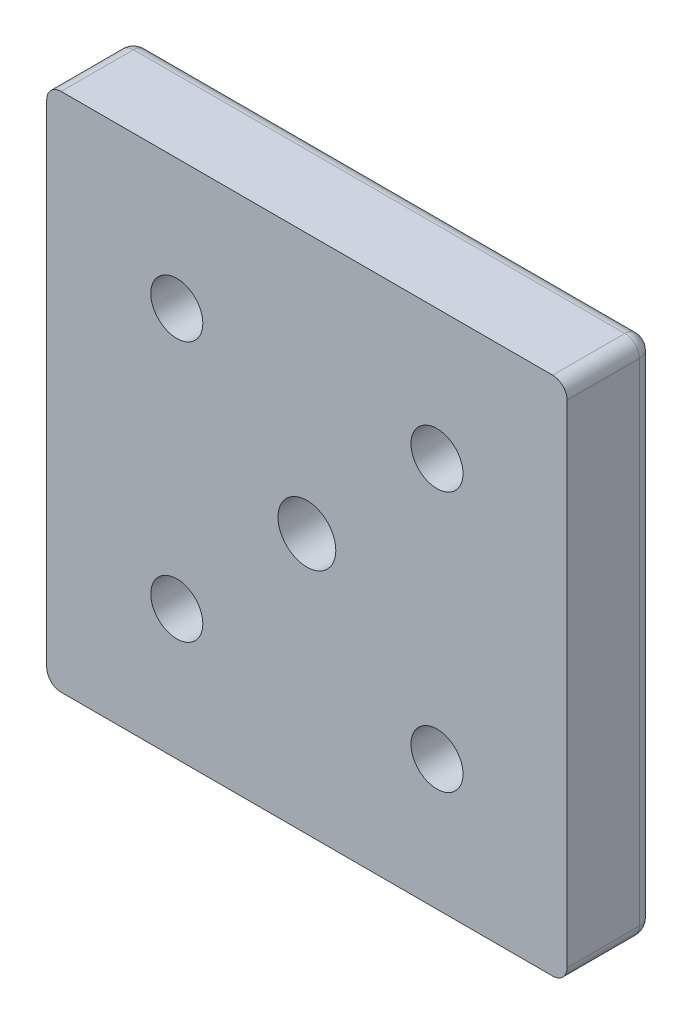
ISO-10303-21;
HEADER;
FILE_DESCRIPTION(('STEP AP214'),'2;1');
FILE_NAME('part.step','',(''),(''),'','','');
FILE_SCHEMA(('AUTOMOTIVE_DESIGN { 1 0 10303 214 1 1 1 1 }'));
ENDSEC;
DATA;
#1=APPLICATION_CONTEXT('core data for automotive mechanical design processes');
#2=APPLICATION_PROTOCOL_DEFINITION('international standard','automotive_design',2000,#1);
#3=PRODUCT_CONTEXT('',#1,'mechanical');
#4=PRODUCT('Part','Part','',(#3));
#5=PRODUCT_RELATED_PRODUCT_CATEGORY('part','',(#4));
#6=PRODUCT_DEFINITION_FORMATION('','',#4);
#7=PRODUCT_DEFINITION_CONTEXT('part definition',#1,'design');
#8=PRODUCT_DEFINITION('design','',#6,#7);
#9=PRODUCT_DEFINITION_SHAPE('','',#8);
#10=(LENGTH_UNIT() NAMED_UNIT(*) SI_UNIT(.MILLI.,.METRE.));
#11=(NAMED_UNIT(*) PLANE_ANGLE_UNIT() SI_UNIT($,.RADIAN.));
#12=(NAMED_UNIT(*) SI_UNIT($,.STERADIAN.) SOLID_ANGLE_UNIT());
#13=UNCERTAINTY_MEASURE_WITH_UNIT(LENGTH_MEASURE(1.E-05),#10,'distance_accuracy_value','');
#14=(GEOMETRIC_REPRESENTATION_CONTEXT(3) GLOBAL_UNCERTAINTY_ASSIGNED_CONTEXT((#13)) GLOBAL_UNIT_ASSIGNED_CONTEXT((#10,
#11,#12)) REPRESENTATION_CONTEXT('',''));
#15=CARTESIAN_POINT('',(0.,0.,0.));
#16=DIRECTION('',(0.,0.,1.));
#17=DIRECTION('',(1.,0.,0.));
#18=AXIS2_PLACEMENT_3D('',#15,#16,#17);
#19=CARTESIAN_POINT('',(22.5,-22.5,0.));
#20=DIRECTION('',(0.,0.,1.));
#21=DIRECTION('',(1.,0.,0.));
#22=AXIS2_PLACEMENT_3D('',#19,#20,#21);
#23=CYLINDRICAL_SURFACE('',#22,7.5);
#24=CARTESIAN_POINT('',(22.5,-22.5,5.5));
#25=DIRECTION('',(0.,0.,1.));
#26=DIRECTION('',(1.,0.,0.));
#27=AXIS2_PLACEMENT_3D('',#24,#25,#26);
#28=CIRCLE('',#27,7.5);
#29=CARTESIAN_POINT('',(30.,-22.5,5.5));
#30=VERTEX_POINT('',#29);
#31=EDGE_CURVE('E271',#30,#30,#28,.T.);
#32=ORIENTED_EDGE('',*,*,#31,.T.);
#33=EDGE_LOOP('',(#32));
#34=FACE_BOUND('',#33,.T.);
#35=CARTESIAN_POINT('',(22.5,-22.5,0.));
#36=DIRECTION('',(0.,0.,1.));
#37=DIRECTION('',(1.,0.,0.));
#38=AXIS2_PLACEMENT_3D('',#35,#36,#37);
#39=CIRCLE('',#38,7.5);
#40=CARTESIAN_POINT('',(30.,-22.5,0.));
#41=VERTEX_POINT('',#40);
#42=EDGE_CURVE('E19',#41,#41,#39,.F.);
#43=ORIENTED_EDGE('',*,*,#42,.T.);
#44=EDGE_LOOP('',(#43));
#45=FACE_BOUND('',#44,.T.);
#46=ADVANCED_FACE('F15',(#34,#45),#23,.F.);
#47=CARTESIAN_POINT('',(-22.5,-22.5,0.));
#48=DIRECTION('',(0.,0.,1.));
#49=DIRECTION('',(1.,0.,0.));
#50=AXIS2_PLACEMENT_3D('',#47,#48,#49);
#51=CYLINDRICAL_SURFACE('',#50,7.5);
#52=CARTESIAN_POINT('',(-22.5,-22.5,5.5));
#53=DIRECTION('',(0.,0.,1.));
#54=DIRECTION('',(1.,0.,0.));
#55=AXIS2_PLACEMENT_3D('',#52,#53,#54);
#56=CIRCLE('',#55,7.5);
#57=CARTESIAN_POINT('',(-15.,-22.5,5.5));
#58=VERTEX_POINT('',#57);
#59=EDGE_CURVE('E267',#58,#58,#56,.T.);
#60=ORIENTED_EDGE('',*,*,#59,.T.);
#61=EDGE_LOOP('',(#60));
#62=FACE_BOUND('',#61,.T.);
#63=CARTESIAN_POINT('',(-22.5,-22.5,0.));
#64=DIRECTION('',(0.,0.,1.));
#65=DIRECTION('',(1.,0.,0.));
#66=AXIS2_PLACEMENT_3D('',#63,#64,#65);
#67=CIRCLE('',#66,7.5);
#68=CARTESIAN_POINT('',(-15.,-22.5,0.));
#69=VERTEX_POINT('',#68);
#70=EDGE_CURVE('E279',#69,#69,#67,.F.);
#71=ORIENTED_EDGE('',*,*,#70,.T.);
#72=EDGE_LOOP('',(#71));
#73=FACE_BOUND('',#72,.T.);
#74=ADVANCED_FACE('F387',(#62,#73),#51,.F.);
#75=CARTESIAN_POINT('',(22.5,22.5,0.));
#76=DIRECTION('',(0.,0.,1.));
#77=DIRECTION('',(1.,0.,0.));
#78=AXIS2_PLACEMENT_3D('',#75,#76,#77);
#79=CYLINDRICAL_SURFACE('',#78,7.5);
#80=CARTESIAN_POINT('',(22.5,22.5,5.5));
#81=DIRECTION('',(0.,0.,1.));
#82=DIRECTION('',(1.,0.,0.));
#83=AXIS2_PLACEMENT_3D('',#80,#81,#82);
#84=CIRCLE('',#83,7.5);
#85=CARTESIAN_POINT('',(30.,22.5,5.5));
#86=VERTEX_POINT('',#85);
#87=EDGE_CURVE('E264',#86,#86,#84,.T.);
#88=ORIENTED_EDGE('',*,*,#87,.T.);
#89=EDGE_LOOP('',(#88));
#90=FACE_BOUND('',#89,.T.);
#91=CARTESIAN_POINT('',(22.5,22.5,0.));
#92=DIRECTION('',(0.,0.,1.));
#93=DIRECTION('',(1.,0.,0.));
#94=AXIS2_PLACEMENT_3D('',#91,#92,#93);
#95=CIRCLE('',#94,7.5);
#96=CARTESIAN_POINT('',(30.,22.5,0.));
#97=VERTEX_POINT('',#96);
#98=EDGE_CURVE('E282',#97,#97,#95,.F.);
#99=ORIENTED_EDGE('',*,*,#98,.T.);
#100=EDGE_LOOP('',(#99));
#101=FACE_BOUND('',#100,.T.);
#102=ADVANCED_FACE('F391',(#90,#101),#79,.F.);
#103=CARTESIAN_POINT('',(-22.5,22.5,0.));
#104=DIRECTION('',(0.,0.,1.));
#105=DIRECTION('',(1.,0.,0.));
#106=AXIS2_PLACEMENT_3D('',#103,#104,#105);
#107=CYLINDRICAL_SURFACE('',#106,7.5);
#108=CARTESIAN_POINT('',(-22.5,22.5,5.5));
#109=DIRECTION('',(0.,0.,1.));
#110=DIRECTION('',(1.,0.,0.));
#111=AXIS2_PLACEMENT_3D('',#108,#109,#110);
#112=CIRCLE('',#111,7.5);
#113=CARTESIAN_POINT('',(-15.,22.5,5.5));
#114=VERTEX_POINT('',#113);
#115=EDGE_CURVE('E125',#114,#114,#112,.T.);
#116=ORIENTED_EDGE('',*,*,#115,.T.);
#117=EDGE_LOOP('',(#116));
#118=FACE_BOUND('',#117,.T.);
#119=CARTESIAN_POINT('',(-22.5,22.5,0.));
#120=DIRECTION('',(0.,0.,1.));
#121=DIRECTION('',(1.,0.,0.));
#122=AXIS2_PLACEMENT_3D('',#119,#120,#121);
#123=CIRCLE('',#122,7.5);
#124=CARTESIAN_POINT('',(-15.,22.5,0.));
#125=VERTEX_POINT('',#124);
#126=EDGE_CURVE('E275',#125,#125,#123,.F.);
#127=ORIENTED_EDGE('',*,*,#126,.T.);
#128=EDGE_LOOP('',(#127));
#129=FACE_BOUND('',#128,.T.);
#130=ADVANCED_FACE('F201',(#118,#129),#107,.F.);
#131=CARTESIAN_POINT('',(42.5,42.5,2.5));
#132=DIRECTION('',(1.,0.,0.));
#133=DIRECTION('',(0.,1.,0.));
#134=AXIS2_PLACEMENT_3D('',#131,#132,#133);
#135=SPHERICAL_SURFACE('',#134,2.5);
#136=CARTESIAN_POINT('',(42.5,42.5,2.5));
#137=DIRECTION('',(0.,0.,1.));
#138=DIRECTION('',(1.,0.,0.));
#139=AXIS2_PLACEMENT_3D('',#136,#137,#138);
#140=CIRCLE('',#139,2.5);
#141=CARTESIAN_POINT('',(45.,42.5,2.5));
#142=VERTEX_POINT('',#141);
#143=CARTESIAN_POINT('',(42.5,45.,2.5));
#144=VERTEX_POINT('',#143);
#145=EDGE_CURVE('E67',#142,#144,#140,.T.);
#146=ORIENTED_EDGE('',*,*,#145,.F.);
#147=CARTESIAN_POINT('',(42.5,42.5,2.5));
#148=DIRECTION('',(0.,1.,0.));
#149=DIRECTION('',(0.,0.,1.));
#150=AXIS2_PLACEMENT_3D('',#147,#148,#149);
#151=CIRCLE('',#150,2.5);
#152=CARTESIAN_POINT('',(42.5,42.5000000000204,0.));
#153=VERTEX_POINT('',#152);
#154=EDGE_CURVE('E105',#153,#142,#151,.F.);
#155=ORIENTED_EDGE('',*,*,#154,.F.);
#156=CARTESIAN_POINT('',(42.5,42.5,2.5));
#157=DIRECTION('',(-1.,0.,0.));
#158=DIRECTION('',(0.,0.,1.));
#159=AXIS2_PLACEMENT_3D('',#156,#157,#158);
#160=CIRCLE('',#159,2.5);
#161=EDGE_CURVE('E102',#144,#153,#160,.T.);
#162=ORIENTED_EDGE('',*,*,#161,.F.);
#163=EDGE_LOOP('',(#146,#155,#162));
#164=FACE_BOUND('',#163,.T.);
#165=ADVANCED_FACE('F104',(#164),#135,.T.);
#166=CARTESIAN_POINT('',(-22.5,42.5,2.5));
#167=DIRECTION('',(-1.,0.,0.));
#168=DIRECTION('',(0.,0.,1.));
#169=AXIS2_PLACEMENT_3D('',#166,#167,#168);
#170=CYLINDRICAL_SURFACE('',#169,2.5);
#171=CARTESIAN_POINT('',(-42.5,42.5,2.5));
#172=DIRECTION('',(1.,0.,0.));
#173=DIRECTION('',(0.,1.,0.));
#174=AXIS2_PLACEMENT_3D('',#171,#172,#173);
#175=CIRCLE('',#174,2.5);
#176=CARTESIAN_POINT('',(-42.5,45.,2.5));
#177=VERTEX_POINT('',#176);
#178=CARTESIAN_POINT('',(-42.5,42.5,0.));
#179=VERTEX_POINT('',#178);
#180=EDGE_CURVE('E109',#177,#179,#175,.F.);
#181=ORIENTED_EDGE('',*,*,#180,.F.);
#182=DIRECTION('',(1.,0.,0.));
#183=VECTOR('',#182,1.);
#184=CARTESIAN_POINT('',(-45.,45.,2.5));
#185=LINE('',#184,#183);
#186=EDGE_CURVE('E112',#144,#177,#185,.F.);
#187=ORIENTED_EDGE('',*,*,#186,.F.);
#188=ORIENTED_EDGE('',*,*,#161,.T.);
#189=DIRECTION('',(1.,0.,0.));
#190=VECTOR('',#189,1.);
#191=CARTESIAN_POINT('',(0.,42.5,0.));
#192=LINE('',#191,#190);
#193=EDGE_CURVE('E150',#153,#179,#192,.F.);
#194=ORIENTED_EDGE('',*,*,#193,.T.);
#195=EDGE_LOOP('',(#181,#187,#188,#194));
#196=FACE_BOUND('',#195,.T.);
#197=ADVANCED_FACE('F113',(#196),#170,.T.);
#198=CARTESIAN_POINT('',(-42.5,42.5,2.5));
#199=DIRECTION('',(1.,0.,0.));
#200=DIRECTION('',(0.,1.,0.));
#201=AXIS2_PLACEMENT_3D('',#198,#199,#200);
#202=SPHERICAL_SURFACE('',#201,2.5);
#203=CARTESIAN_POINT('',(-42.5,42.5,2.5));
#204=DIRECTION('',(0.,0.,1.));
#205=DIRECTION('',(1.,0.,0.));
#206=AXIS2_PLACEMENT_3D('',#203,#204,#205);
#207=CIRCLE('',#206,2.5);
#208=CARTESIAN_POINT('',(-45.,42.5,2.5));
#209=VERTEX_POINT('',#208);
#210=EDGE_CURVE('E130',#177,#209,#207,.T.);
#211=ORIENTED_EDGE('',*,*,#210,.F.);
#212=ORIENTED_EDGE('',*,*,#180,.T.);
#213=CARTESIAN_POINT('',(-42.5,42.5,2.5));
#214=DIRECTION('',(0.,-1.,0.));
#215=DIRECTION('',(0.,0.,-1.));
#216=AXIS2_PLACEMENT_3D('',#213,#214,#215);
#217=CIRCLE('',#216,2.5);
#218=EDGE_CURVE('E185',#209,#179,#217,.T.);
#219=ORIENTED_EDGE('',*,*,#218,.F.);
#220=EDGE_LOOP('',(#211,#212,#219));
#221=FACE_BOUND('',#220,.T.);
#222=ADVANCED_FACE('F192',(#221),#202,.T.);
#223=CARTESIAN_POINT('',(-42.5,-22.5,2.5));
#224=DIRECTION('',(0.,-1.,0.));
#225=DIRECTION('',(0.,0.,-1.));
#226=AXIS2_PLACEMENT_3D('',#223,#224,#225);
#227=CYLINDRICAL_SURFACE('',#226,2.5);
#228=CARTESIAN_POINT('',(-42.5,-42.5,2.5));
#229=DIRECTION('',(0.,1.,-9.81305763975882E-11));
#230=DIRECTION('',(1.,0.,0.));
#231=AXIS2_PLACEMENT_3D('',#228,#229,#230);
#232=CIRCLE('',#231,2.5);
#233=CARTESIAN_POINT('',(-45.,-42.5,2.5));
#234=VERTEX_POINT('',#233);
#235=CARTESIAN_POINT('',(-42.5,-42.5000000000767,0.));
#236=VERTEX_POINT('',#235);
#237=EDGE_CURVE('E183',#234,#236,#232,.F.);
#238=ORIENTED_EDGE('',*,*,#237,.F.);
#239=DIRECTION('',(0.,1.,0.));
#240=VECTOR('',#239,1.);
#241=CARTESIAN_POINT('',(-45.,-45.,2.5));
#242=LINE('',#241,#240);
#243=EDGE_CURVE('E181',#209,#234,#242,.F.);
#244=ORIENTED_EDGE('',*,*,#243,.F.);
#245=ORIENTED_EDGE('',*,*,#218,.T.);
#246=DIRECTION('',(0.,1.,0.));
#247=VECTOR('',#246,1.);
#248=CARTESIAN_POINT('',(-42.5,0.,0.));
#249=LINE('',#248,#247);
#250=EDGE_CURVE('E210',#179,#236,#249,.F.);
#251=ORIENTED_EDGE('',*,*,#250,.T.);
#252=EDGE_LOOP('',(#238,#244,#245,#251));
#253=FACE_BOUND('',#252,.T.);
#254=ADVANCED_FACE('F175',(#253),#227,.T.);
#255=CARTESIAN_POINT('',(-42.5,-42.5,2.5));
#256=DIRECTION('',(1.,0.,0.));
#257=DIRECTION('',(0.,1.,0.));
#258=AXIS2_PLACEMENT_3D('',#255,#256,#257);
#259=SPHERICAL_SURFACE('',#258,2.5);
#260=CARTESIAN_POINT('',(-42.5,-42.5,2.5));
#261=DIRECTION('',(0.,0.,1.));
#262=DIRECTION('',(1.,0.,0.));
#263=AXIS2_PLACEMENT_3D('',#260,#261,#262);
#264=CIRCLE('',#263,2.5);
#265=CARTESIAN_POINT('',(-42.5,-45.,2.5));
#266=VERTEX_POINT('',#265);
#267=EDGE_CURVE('E308',#234,#266,#264,.T.);
#268=ORIENTED_EDGE('',*,*,#267,.F.);
#269=ORIENTED_EDGE('',*,*,#237,.T.);
#270=CARTESIAN_POINT('',(-42.5,-42.5,2.5));
#271=DIRECTION('',(1.,0.,0.));
#272=DIRECTION('',(0.,0.,-1.));
#273=AXIS2_PLACEMENT_3D('',#270,#271,#272);
#274=CIRCLE('',#273,2.5);
#275=EDGE_CURVE('E184',#266,#236,#274,.T.);
#276=ORIENTED_EDGE('',*,*,#275,.F.);
#277=EDGE_LOOP('',(#268,#269,#276));
#278=FACE_BOUND('',#277,.T.);
#279=ADVANCED_FACE('F170',(#278),#259,.T.);
#280=CARTESIAN_POINT('',(22.5,-42.5,2.5));
#281=DIRECTION('',(1.,0.,0.));
#282=DIRECTION('',(0.,0.,-1.));
#283=AXIS2_PLACEMENT_3D('',#280,#281,#282);
#284=CYLINDRICAL_SURFACE('',#283,2.5);
#285=CARTESIAN_POINT('',(42.5,-42.5,2.5));
#286=DIRECTION('',(1.,0.,0.));
#287=DIRECTION('',(0.,1.,0.));
#288=AXIS2_PLACEMENT_3D('',#285,#286,#287);
#289=CIRCLE('',#288,2.5);
#290=CARTESIAN_POINT('',(42.5,-45.,2.50000000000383));
#291=VERTEX_POINT('',#290);
#292=CARTESIAN_POINT('',(42.5,-42.5,0.));
#293=VERTEX_POINT('',#292);
#294=EDGE_CURVE('E148',#291,#293,#289,.T.);
#295=ORIENTED_EDGE('',*,*,#294,.F.);
#296=DIRECTION('',(1.,0.,0.));
#297=VECTOR('',#296,1.);
#298=CARTESIAN_POINT('',(45.,-45.,2.5));
#299=LINE('',#298,#297);
#300=EDGE_CURVE('E151',#266,#291,#299,.T.);
#301=ORIENTED_EDGE('',*,*,#300,.F.);
#302=ORIENTED_EDGE('',*,*,#275,.T.);
#303=DIRECTION('',(1.,0.,0.));
#304=VECTOR('',#303,1.);
#305=CARTESIAN_POINT('',(0.,-42.5,0.));
#306=LINE('',#305,#304);
#307=EDGE_CURVE('E207',#236,#293,#306,.T.);
#308=ORIENTED_EDGE('',*,*,#307,.T.);
#309=EDGE_LOOP('',(#295,#301,#302,#308));
#310=FACE_BOUND('',#309,.T.);
#311=ADVANCED_FACE('F165',(#310),#284,.T.);
#312=CARTESIAN_POINT('',(42.5,-42.5,2.5));
#313=DIRECTION('',(1.,0.,0.));
#314=DIRECTION('',(0.,1.,0.));
#315=AXIS2_PLACEMENT_3D('',#312,#313,#314);
#316=SPHERICAL_SURFACE('',#315,2.5);
#317=CARTESIAN_POINT('',(42.5,-42.5,2.5));
#318=DIRECTION('',(0.,0.,1.));
#319=DIRECTION('',(1.,0.,0.));
#320=AXIS2_PLACEMENT_3D('',#317,#318,#319);
#321=CIRCLE('',#320,2.5);
#322=CARTESIAN_POINT('',(45.,-42.5,2.5));
#323=VERTEX_POINT('',#322);
#324=EDGE_CURVE('E139',#291,#323,#321,.T.);
#325=ORIENTED_EDGE('',*,*,#324,.F.);
#326=ORIENTED_EDGE('',*,*,#294,.T.);
#327=CARTESIAN_POINT('',(42.5,-42.5,2.5));
#328=DIRECTION('',(0.,1.,0.));
#329=DIRECTION('',(0.,0.,1.));
#330=AXIS2_PLACEMENT_3D('',#327,#328,#329);
#331=CIRCLE('',#330,2.5);
#332=EDGE_CURVE('E145',#323,#293,#331,.T.);
#333=ORIENTED_EDGE('',*,*,#332,.F.);
#334=EDGE_LOOP('',(#325,#326,#333));
#335=FACE_BOUND('',#334,.T.);
#336=ADVANCED_FACE('F160',(#335),#316,.T.);
#337=CARTESIAN_POINT('',(42.5,22.5,2.5));
#338=DIRECTION('',(0.,1.,0.));
#339=DIRECTION('',(0.,0.,1.));
#340=AXIS2_PLACEMENT_3D('',#337,#338,#339);
#341=CYLINDRICAL_SURFACE('',#340,2.5);
#342=ORIENTED_EDGE('',*,*,#154,.T.);
#343=DIRECTION('',(0.,1.,0.));
#344=VECTOR('',#343,1.);
#345=CARTESIAN_POINT('',(45.,45.,2.5));
#346=LINE('',#345,#344);
#347=EDGE_CURVE('E143',#323,#142,#346,.T.);
#348=ORIENTED_EDGE('',*,*,#347,.F.);
#349=ORIENTED_EDGE('',*,*,#332,.T.);
#350=DIRECTION('',(0.,1.,0.));
#351=VECTOR('',#350,1.);
#352=CARTESIAN_POINT('',(42.5,0.,0.));
#353=LINE('',#352,#351);
#354=EDGE_CURVE('E205',#293,#153,#353,.T.);
#355=ORIENTED_EDGE('',*,*,#354,.T.);
#356=EDGE_LOOP('',(#342,#348,#349,#355));
#357=FACE_BOUND('',#356,.T.);
#358=ADVANCED_FACE('F164',(#357),#341,.T.);
#359=CARTESIAN_POINT('',(0.,0.,0.));
#360=DIRECTION('',(0.,0.,1.));
#361=DIRECTION('',(1.,0.,0.));
#362=AXIS2_PLACEMENT_3D('',#359,#360,#361);
#363=PLANE('',#362);
#364=ORIENTED_EDGE('',*,*,#126,.F.);
#365=EDGE_LOOP('',(#364));
#366=FACE_BOUND('',#365,.T.);
#367=ORIENTED_EDGE('',*,*,#70,.F.);
#368=EDGE_LOOP('',(#367));
#369=FACE_BOUND('',#368,.T.);
#370=ORIENTED_EDGE('',*,*,#98,.F.);
#371=EDGE_LOOP('',(#370));
#372=FACE_BOUND('',#371,.T.);
#373=ORIENTED_EDGE('',*,*,#42,.F.);
#374=EDGE_LOOP('',(#373));
#375=FACE_BOUND('',#374,.T.);
#376=CARTESIAN_POINT('',(0.,0.,0.));
#377=DIRECTION('',(0.,0.,1.));
#378=DIRECTION('',(1.,0.,0.));
#379=AXIS2_PLACEMENT_3D('',#376,#377,#378);
#380=CIRCLE('',#379,5.);
#381=CARTESIAN_POINT('',(5.,0.,0.));
#382=VERTEX_POINT('',#381);
#383=EDGE_CURVE('E258',#382,#382,#380,.T.);
#384=ORIENTED_EDGE('',*,*,#383,.T.);
#385=EDGE_LOOP('',(#384));
#386=FACE_BOUND('',#385,.T.);
#387=ORIENTED_EDGE('',*,*,#307,.F.);
#388=ORIENTED_EDGE('',*,*,#250,.F.);
#389=ORIENTED_EDGE('',*,*,#193,.F.);
#390=ORIENTED_EDGE('',*,*,#354,.F.);
#391=EDGE_LOOP('',(#387,#388,#389,#390));
#392=FACE_BOUND('',#391,.T.);
#393=ADVANCED_FACE('F292',(#366,#369,#372,#375,#386,#392),#363,.F.);
#394=CARTESIAN_POINT('',(30.15,-14.85,5.5));
#395=DIRECTION('',(0.,0.,1.));
#396=DIRECTION('',(-1.,0.,0.));
#397=AXIS2_PLACEMENT_3D('',#394,#395,#396);
#398=PLANE('',#397);
#399=CARTESIAN_POINT('',(22.5,-22.5,5.5));
#400=DIRECTION('',(0.,0.,1.));
#401=DIRECTION('',(1.,0.,0.));
#402=AXIS2_PLACEMENT_3D('',#399,#400,#401);
#403=CIRCLE('',#402,4.5);
#404=CARTESIAN_POINT('',(27.,-22.5,5.5));
#405=VERTEX_POINT('',#404);
#406=EDGE_CURVE('E254',#405,#405,#403,.T.);
#407=ORIENTED_EDGE('',*,*,#406,.T.);
#408=EDGE_LOOP('',(#407));
#409=FACE_BOUND('',#408,.T.);
#410=ORIENTED_EDGE('',*,*,#31,.F.);
#411=EDGE_LOOP('',(#410));
#412=FACE_BOUND('',#411,.T.);
#413=ADVANCED_FACE('F295',(#409,#412),#398,.F.);
#414=CARTESIAN_POINT('',(-14.85,-14.85,5.5));
#415=DIRECTION('',(0.,0.,1.));
#416=DIRECTION('',(-1.,0.,0.));
#417=AXIS2_PLACEMENT_3D('',#414,#415,#416);
#418=PLANE('',#417);
#419=CARTESIAN_POINT('',(-22.5,-22.5,5.5));
#420=DIRECTION('',(0.,0.,1.));
#421=DIRECTION('',(1.,0.,0.));
#422=AXIS2_PLACEMENT_3D('',#419,#420,#421);
#423=CIRCLE('',#422,4.5);
#424=CARTESIAN_POINT('',(-18.,-22.5,5.5));
#425=VERTEX_POINT('',#424);
#426=EDGE_CURVE('E250',#425,#425,#423,.T.);
#427=ORIENTED_EDGE('',*,*,#426,.T.);
#428=EDGE_LOOP('',(#427));
#429=FACE_BOUND('',#428,.T.);
#430=ORIENTED_EDGE('',*,*,#59,.F.);
#431=EDGE_LOOP('',(#430));
#432=FACE_BOUND('',#431,.T.);
#433=ADVANCED_FACE('F382',(#429,#432),#418,.F.);
#434=CARTESIAN_POINT('',(30.15,30.15,5.5));
#435=DIRECTION('',(0.,0.,1.));
#436=DIRECTION('',(-1.,0.,0.));
#437=AXIS2_PLACEMENT_3D('',#434,#435,#436);
#438=PLANE('',#437);
#439=CARTESIAN_POINT('',(22.5,22.5,5.5));
#440=DIRECTION('',(0.,0.,1.));
#441=DIRECTION('',(1.,0.,0.));
#442=AXIS2_PLACEMENT_3D('',#439,#440,#441);
#443=CIRCLE('',#442,4.5);
#444=CARTESIAN_POINT('',(27.,22.5,5.5));
#445=VERTEX_POINT('',#444);
#446=EDGE_CURVE('E247',#445,#445,#443,.T.);
#447=ORIENTED_EDGE('',*,*,#446,.T.);
#448=EDGE_LOOP('',(#447));
#449=FACE_BOUND('',#448,.T.);
#450=ORIENTED_EDGE('',*,*,#87,.F.);
#451=EDGE_LOOP('',(#450));
#452=FACE_BOUND('',#451,.T.);
#453=ADVANCED_FACE('F404',(#449,#452),#438,.F.);
#454=CARTESIAN_POINT('',(-14.85,30.15,5.5));
#455=DIRECTION('',(0.,0.,1.));
#456=DIRECTION('',(-1.,0.,0.));
#457=AXIS2_PLACEMENT_3D('',#454,#455,#456);
#458=PLANE('',#457);
#459=CARTESIAN_POINT('',(-22.5,22.5,5.5));
#460=DIRECTION('',(0.,0.,1.));
#461=DIRECTION('',(1.,0.,0.));
#462=AXIS2_PLACEMENT_3D('',#459,#460,#461);
#463=CIRCLE('',#462,4.5);
#464=CARTESIAN_POINT('',(-18.,22.5,5.5));
#465=VERTEX_POINT('',#464);
#466=EDGE_CURVE('E243',#465,#465,#463,.T.);
#467=ORIENTED_EDGE('',*,*,#466,.T.);
#468=EDGE_LOOP('',(#467));
#469=FACE_BOUND('',#468,.T.);
#470=ORIENTED_EDGE('',*,*,#115,.F.);
#471=EDGE_LOOP('',(#470));
#472=FACE_BOUND('',#471,.T.);
#473=ADVANCED_FACE('F17',(#469,#472),#458,.F.);
#474=CARTESIAN_POINT('',(42.5,42.5,0.));
#475=DIRECTION('',(0.,0.,1.));
#476=DIRECTION('',(1.,0.,0.));
#477=AXIS2_PLACEMENT_3D('',#474,#475,#476);
#478=CYLINDRICAL_SURFACE('',#477,2.5);
#479=CARTESIAN_POINT('',(42.5,42.5,15.));
#480=DIRECTION('',(0.,0.,1.));
#481=DIRECTION('',(1.,0.,0.));
#482=AXIS2_PLACEMENT_3D('',#479,#480,#481);
#483=CIRCLE('',#482,2.5);
#484=CARTESIAN_POINT('',(45.,42.5,15.));
#485=VERTEX_POINT('',#484);
#486=CARTESIAN_POINT('',(42.5,45.,15.));
#487=VERTEX_POINT('',#486);
#488=EDGE_CURVE('E58',#485,#487,#483,.T.);
#489=ORIENTED_EDGE('',*,*,#488,.F.);
#490=DIRECTION('',(0.,0.,-1.));
#491=VECTOR('',#490,1.);
#492=CARTESIAN_POINT('',(45.,42.5,0.));
#493=LINE('',#492,#491);
#494=EDGE_CURVE('E123',#142,#485,#493,.F.);
#495=ORIENTED_EDGE('',*,*,#494,.F.);
#496=ORIENTED_EDGE('',*,*,#145,.T.);
#497=DIRECTION('',(0.,0.,1.));
#498=VECTOR('',#497,1.);
#499=CARTESIAN_POINT('',(42.5,45.,0.));
#500=LINE('',#499,#498);
#501=EDGE_CURVE('E119',#487,#144,#500,.F.);
#502=ORIENTED_EDGE('',*,*,#501,.F.);
#503=EDGE_LOOP('',(#489,#495,#496,#502));
#504=FACE_BOUND('',#503,.T.);
#505=ADVANCED_FACE('F121',(#504),#478,.T.);
#506=CARTESIAN_POINT('',(-45.,45.,0.));
#507=DIRECTION('',(0.,1.,0.));
#508=DIRECTION('',(0.,0.,1.));
#509=AXIS2_PLACEMENT_3D('',#506,#507,#508);
#510=PLANE('',#509);
#511=DIRECTION('',(1.,0.,0.));
#512=VECTOR('',#511,1.);
#513=CARTESIAN_POINT('',(0.,45.,15.));
#514=LINE('',#513,#512);
#515=CARTESIAN_POINT('',(-42.5,45.,15.));
#516=VERTEX_POINT('',#515);
#517=EDGE_CURVE('E129',#487,#516,#514,.F.);
#518=ORIENTED_EDGE('',*,*,#517,.F.);
#519=ORIENTED_EDGE('',*,*,#501,.T.);
#520=ORIENTED_EDGE('',*,*,#186,.T.);
#521=DIRECTION('',(0.,0.,1.));
#522=VECTOR('',#521,1.);
#523=CARTESIAN_POINT('',(-42.5,45.,0.));
#524=LINE('',#523,#522);
#525=EDGE_CURVE('E134',#516,#177,#524,.F.);
#526=ORIENTED_EDGE('',*,*,#525,.F.);
#527=EDGE_LOOP('',(#518,#519,#520,#526));
#528=FACE_BOUND('',#527,.T.);
#529=ADVANCED_FACE('F127',(#528),#510,.T.);
#530=CARTESIAN_POINT('',(-42.5,42.5,0.));
#531=DIRECTION('',(0.,0.,1.));
#532=DIRECTION('',(1.,0.,0.));
#533=AXIS2_PLACEMENT_3D('',#530,#531,#532);
#534=CYLINDRICAL_SURFACE('',#533,2.5);
#535=CARTESIAN_POINT('',(-42.5,42.5,15.));
#536=DIRECTION('',(0.,0.,1.));
#537=DIRECTION('',(1.,0.,0.));
#538=AXIS2_PLACEMENT_3D('',#535,#536,#537);
#539=CIRCLE('',#538,2.5);
#540=CARTESIAN_POINT('',(-45.,42.5,15.));
#541=VERTEX_POINT('',#540);
#542=EDGE_CURVE('E239',#516,#541,#539,.T.);
#543=ORIENTED_EDGE('',*,*,#542,.F.);
#544=ORIENTED_EDGE('',*,*,#525,.T.);
#545=ORIENTED_EDGE('',*,*,#210,.T.);
#546=DIRECTION('',(0.,0.,1.));
#547=VECTOR('',#546,1.);
#548=CARTESIAN_POINT('',(-45.,42.5,0.));
#549=LINE('',#548,#547);
#550=EDGE_CURVE('E310',#541,#209,#549,.F.);
#551=ORIENTED_EDGE('',*,*,#550,.F.);
#552=EDGE_LOOP('',(#543,#544,#545,#551));
#553=FACE_BOUND('',#552,.T.);
#554=ADVANCED_FACE('F432',(#553),#534,.T.);
#555=CARTESIAN_POINT('',(-45.,-45.,0.));
#556=DIRECTION('',(-1.,0.,0.));
#557=DIRECTION('',(0.,0.,1.));
#558=AXIS2_PLACEMENT_3D('',#555,#556,#557);
#559=PLANE('',#558);
#560=DIRECTION('',(0.,1.,0.));
#561=VECTOR('',#560,1.);
#562=CARTESIAN_POINT('',(-45.,0.,15.));
#563=LINE('',#562,#561);
#564=CARTESIAN_POINT('',(-45.,-42.5,15.));
#565=VERTEX_POINT('',#564);
#566=EDGE_CURVE('E238',#541,#565,#563,.F.);
#567=ORIENTED_EDGE('',*,*,#566,.F.);
#568=ORIENTED_EDGE('',*,*,#550,.T.);
#569=ORIENTED_EDGE('',*,*,#243,.T.);
#570=DIRECTION('',(0.,0.,1.));
#571=VECTOR('',#570,1.);
#572=CARTESIAN_POINT('',(-45.,-42.5,0.));
#573=LINE('',#572,#571);
#574=EDGE_CURVE('E155',#565,#234,#573,.F.);
#575=ORIENTED_EDGE('',*,*,#574,.F.);
#576=EDGE_LOOP('',(#567,#568,#569,#575));
#577=FACE_BOUND('',#576,.T.);
#578=ADVANCED_FACE('F437',(#577),#559,.T.);
#579=CARTESIAN_POINT('',(-42.5,-42.5,0.));
#580=DIRECTION('',(0.,0.,1.));
#581=DIRECTION('',(1.,0.,0.));
#582=AXIS2_PLACEMENT_3D('',#579,#580,#581);
#583=CYLINDRICAL_SURFACE('',#582,2.5);
#584=CARTESIAN_POINT('',(-42.5,-42.5,15.));
#585=DIRECTION('',(0.,0.,1.));
#586=DIRECTION('',(1.,0.,0.));
#587=AXIS2_PLACEMENT_3D('',#584,#585,#586);
#588=CIRCLE('',#587,2.5);
#589=CARTESIAN_POINT('',(-42.5,-45.,15.));
#590=VERTEX_POINT('',#589);
#591=EDGE_CURVE('E235',#565,#590,#588,.T.);
#592=ORIENTED_EDGE('',*,*,#591,.F.);
#593=ORIENTED_EDGE('',*,*,#574,.T.);
#594=ORIENTED_EDGE('',*,*,#267,.T.);
#595=DIRECTION('',(0.,0.,-1.));
#596=VECTOR('',#595,1.);
#597=CARTESIAN_POINT('',(-42.5,-45.,0.));
#598=LINE('',#597,#596);
#599=EDGE_CURVE('E142',#590,#266,#598,.T.);
#600=ORIENTED_EDGE('',*,*,#599,.F.);
#601=EDGE_LOOP('',(#592,#593,#594,#600));
#602=FACE_BOUND('',#601,.T.);
#603=ADVANCED_FACE('F441',(#602),#583,.T.);
#604=CARTESIAN_POINT('',(45.,-45.,0.));
#605=DIRECTION('',(0.,-1.,0.));
#606=DIRECTION('',(0.,0.,-1.));
#607=AXIS2_PLACEMENT_3D('',#604,#605,#606);
#608=PLANE('',#607);
#609=DIRECTION('',(1.,0.,0.));
#610=VECTOR('',#609,1.);
#611=CARTESIAN_POINT('',(0.,-45.,15.));
#612=LINE('',#611,#610);
#613=CARTESIAN_POINT('',(42.5,-45.,15.));
#614=VERTEX_POINT('',#613);
#615=EDGE_CURVE('E234',#590,#614,#612,.T.);
#616=ORIENTED_EDGE('',*,*,#615,.F.);
#617=ORIENTED_EDGE('',*,*,#599,.T.);
#618=ORIENTED_EDGE('',*,*,#300,.T.);
#619=DIRECTION('',(0.,0.,1.));
#620=VECTOR('',#619,1.);
#621=CARTESIAN_POINT('',(42.5,-45.,0.));
#622=LINE('',#621,#620);
#623=EDGE_CURVE('E141',#614,#291,#622,.F.);
#624=ORIENTED_EDGE('',*,*,#623,.F.);
#625=EDGE_LOOP('',(#616,#617,#618,#624));
#626=FACE_BOUND('',#625,.T.);
#627=ADVANCED_FACE('F352',(#626),#608,.T.);
#628=CARTESIAN_POINT('',(42.5,-42.5,0.));
#629=DIRECTION('',(0.,0.,1.));
#630=DIRECTION('',(1.,0.,0.));
#631=AXIS2_PLACEMENT_3D('',#628,#629,#630);
#632=CYLINDRICAL_SURFACE('',#631,2.5);
#633=CARTESIAN_POINT('',(42.5,-42.5,15.));
#634=DIRECTION('',(0.,0.,1.));
#635=DIRECTION('',(1.,0.,0.));
#636=AXIS2_PLACEMENT_3D('',#633,#634,#635);
#637=CIRCLE('',#636,2.5);
#638=CARTESIAN_POINT('',(45.,-42.5,15.));
#639=VERTEX_POINT('',#638);
#640=EDGE_CURVE('E231',#614,#639,#637,.T.);
#641=ORIENTED_EDGE('',*,*,#640,.F.);
#642=ORIENTED_EDGE('',*,*,#623,.T.);
#643=ORIENTED_EDGE('',*,*,#324,.T.);
#644=DIRECTION('',(0.,0.,-1.));
#645=VECTOR('',#644,1.);
#646=CARTESIAN_POINT('',(45.,-42.5,0.));
#647=LINE('',#646,#645);
#648=EDGE_CURVE('E34',#639,#323,#647,.T.);
#649=ORIENTED_EDGE('',*,*,#648,.F.);
#650=EDGE_LOOP('',(#641,#642,#643,#649));
#651=FACE_BOUND('',#650,.T.);
#652=ADVANCED_FACE('F342',(#651),#632,.T.);
#653=CARTESIAN_POINT('',(45.,45.,0.));
#654=DIRECTION('',(1.,0.,0.));
#655=DIRECTION('',(0.,0.,-1.));
#656=AXIS2_PLACEMENT_3D('',#653,#654,#655);
#657=PLANE('',#656);
#658=DIRECTION('',(0.,1.,0.));
#659=VECTOR('',#658,1.);
#660=CARTESIAN_POINT('',(45.,0.,15.));
#661=LINE('',#660,#659);
#662=EDGE_CURVE('E230',#639,#485,#661,.T.);
#663=ORIENTED_EDGE('',*,*,#662,.F.);
#664=ORIENTED_EDGE('',*,*,#648,.T.);
#665=ORIENTED_EDGE('',*,*,#347,.T.);
#666=ORIENTED_EDGE('',*,*,#494,.T.);
#667=EDGE_LOOP('',(#663,#664,#665,#666));
#668=FACE_BOUND('',#667,.T.);
#669=ADVANCED_FACE('F339',(#668),#657,.T.);
#670=CARTESIAN_POINT('',(0.,0.,0.));
#671=DIRECTION('',(0.,0.,1.));
#672=DIRECTION('',(1.,0.,0.));
#673=AXIS2_PLACEMENT_3D('',#670,#671,#672);
#674=CYLINDRICAL_SURFACE('',#673,5.);
#675=ORIENTED_EDGE('',*,*,#383,.F.);
#676=EDGE_LOOP('',(#675));
#677=FACE_BOUND('',#676,.T.);
#678=CARTESIAN_POINT('',(0.,0.,15.));
#679=DIRECTION('',(0.,0.,1.));
#680=DIRECTION('',(1.,0.,0.));
#681=AXIS2_PLACEMENT_3D('',#678,#679,#680);
#682=CIRCLE('',#681,5.);
#683=CARTESIAN_POINT('',(5.,0.,15.));
#684=VERTEX_POINT('',#683);
#685=EDGE_CURVE('E227',#684,#684,#682,.F.);
#686=ORIENTED_EDGE('',*,*,#685,.F.);
#687=EDGE_LOOP('',(#686));
#688=FACE_BOUND('',#687,.T.);
#689=ADVANCED_FACE('F341',(#677,#688),#674,.F.);
#690=CARTESIAN_POINT('',(22.5,-22.5,0.));
#691=DIRECTION('',(0.,0.,1.));
#692=DIRECTION('',(1.,0.,0.));
#693=AXIS2_PLACEMENT_3D('',#690,#691,#692);
#694=CYLINDRICAL_SURFACE('',#693,4.5);
#695=CARTESIAN_POINT('',(22.5,-22.5,15.));
#696=DIRECTION('',(0.,0.,1.));
#697=DIRECTION('',(1.,0.,0.));
#698=AXIS2_PLACEMENT_3D('',#695,#696,#697);
#699=CIRCLE('',#698,4.5);
#700=CARTESIAN_POINT('',(27.,-22.5,15.));
#701=VERTEX_POINT('',#700);
#702=EDGE_CURVE('E223',#701,#701,#699,.F.);
#703=ORIENTED_EDGE('',*,*,#702,.F.);
#704=EDGE_LOOP('',(#703));
#705=FACE_BOUND('',#704,.T.);
#706=ORIENTED_EDGE('',*,*,#406,.F.);
#707=EDGE_LOOP('',(#706));
#708=FACE_BOUND('',#707,.T.);
#709=ADVANCED_FACE('F349',(#705,#708),#694,.F.);
#710=CARTESIAN_POINT('',(-22.5,-22.5,0.));
#711=DIRECTION('',(0.,0.,1.));
#712=DIRECTION('',(1.,0.,0.));
#713=AXIS2_PLACEMENT_3D('',#710,#711,#712);
#714=CYLINDRICAL_SURFACE('',#713,4.5);
#715=CARTESIAN_POINT('',(-22.5,-22.5,15.));
#716=DIRECTION('',(0.,0.,1.));
#717=DIRECTION('',(1.,0.,0.));
#718=AXIS2_PLACEMENT_3D('',#715,#716,#717);
#719=CIRCLE('',#718,4.5);
#720=CARTESIAN_POINT('',(-18.,-22.5,15.));
#721=VERTEX_POINT('',#720);
#722=EDGE_CURVE('E219',#721,#721,#719,.F.);
#723=ORIENTED_EDGE('',*,*,#722,.F.);
#724=EDGE_LOOP('',(#723));
#725=FACE_BOUND('',#724,.T.);
#726=ORIENTED_EDGE('',*,*,#426,.F.);
#727=EDGE_LOOP('',(#726));
#728=FACE_BOUND('',#727,.T.);
#729=ADVANCED_FACE('F368',(#725,#728),#714,.F.);
#730=CARTESIAN_POINT('',(22.5,22.5,0.));
#731=DIRECTION('',(0.,0.,1.));
#732=DIRECTION('',(1.,0.,0.));
#733=AXIS2_PLACEMENT_3D('',#730,#731,#732);
#734=CYLINDRICAL_SURFACE('',#733,4.5);
#735=CARTESIAN_POINT('',(22.5,22.5,15.));
#736=DIRECTION('',(0.,0.,1.));
#737=DIRECTION('',(1.,0.,0.));
#738=AXIS2_PLACEMENT_3D('',#735,#736,#737);
#739=CIRCLE('',#738,4.5);
#740=CARTESIAN_POINT('',(27.,22.5,15.));
#741=VERTEX_POINT('',#740);
#742=EDGE_CURVE('E25',#741,#741,#739,.F.);
#743=ORIENTED_EDGE('',*,*,#742,.F.);
#744=EDGE_LOOP('',(#743));
#745=FACE_BOUND('',#744,.T.);
#746=ORIENTED_EDGE('',*,*,#446,.F.);
#747=EDGE_LOOP('',(#746));
#748=FACE_BOUND('',#747,.T.);
#749=ADVANCED_FACE('F361',(#745,#748),#734,.F.);
#750=CARTESIAN_POINT('',(-22.5,22.5,0.));
#751=DIRECTION('',(0.,0.,1.));
#752=DIRECTION('',(1.,0.,0.));
#753=AXIS2_PLACEMENT_3D('',#750,#751,#752);
#754=CYLINDRICAL_SURFACE('',#753,4.5);
#755=CARTESIAN_POINT('',(-22.5,22.5,15.));
#756=DIRECTION('',(0.,0.,1.));
#757=DIRECTION('',(1.,0.,0.));
#758=AXIS2_PLACEMENT_3D('',#755,#756,#757);
#759=CIRCLE('',#758,4.5);
#760=CARTESIAN_POINT('',(-18.,22.5,15.));
#761=VERTEX_POINT('',#760);
#762=EDGE_CURVE('E10',#761,#761,#759,.F.);
#763=ORIENTED_EDGE('',*,*,#762,.F.);
#764=EDGE_LOOP('',(#763));
#765=FACE_BOUND('',#764,.T.);
#766=ORIENTED_EDGE('',*,*,#466,.F.);
#767=EDGE_LOOP('',(#766));
#768=FACE_BOUND('',#767,.T.);
#769=ADVANCED_FACE('F355',(#765,#768),#754,.F.);
#770=CARTESIAN_POINT('',(0.,0.,15.));
#771=DIRECTION('',(0.,0.,1.));
#772=DIRECTION('',(1.,0.,0.));
#773=AXIS2_PLACEMENT_3D('',#770,#771,#772);
#774=PLANE('',#773);
#775=ORIENTED_EDGE('',*,*,#762,.T.);
#776=EDGE_LOOP('',(#775));
#777=FACE_BOUND('',#776,.T.);
#778=ORIENTED_EDGE('',*,*,#742,.T.);
#779=EDGE_LOOP('',(#778));
#780=FACE_BOUND('',#779,.T.);
#781=ORIENTED_EDGE('',*,*,#722,.T.);
#782=EDGE_LOOP('',(#781));
#783=FACE_BOUND('',#782,.T.);
#784=ORIENTED_EDGE('',*,*,#702,.T.);
#785=EDGE_LOOP('',(#784));
#786=FACE_BOUND('',#785,.T.);
#787=ORIENTED_EDGE('',*,*,#685,.T.);
#788=EDGE_LOOP('',(#787));
#789=FACE_BOUND('',#788,.T.);
#790=ORIENTED_EDGE('',*,*,#640,.T.);
#791=ORIENTED_EDGE('',*,*,#662,.T.);
#792=ORIENTED_EDGE('',*,*,#488,.T.);
#793=ORIENTED_EDGE('',*,*,#517,.T.);
#794=ORIENTED_EDGE('',*,*,#542,.T.);
#795=ORIENTED_EDGE('',*,*,#566,.T.);
#796=ORIENTED_EDGE('',*,*,#591,.T.);
#797=ORIENTED_EDGE('',*,*,#615,.T.);
#798=EDGE_LOOP('',(#790,#791,#792,#793,#794,#795,#796,#797));
#799=FACE_BOUND('',#798,.T.);
#800=ADVANCED_FACE('F337',(#777,#780,#783,#786,#789,#799),#774,.T.);
#801=CLOSED_SHELL('',(#46,#74,#102,#130,#165,#197,#222,#254,#279,#311,#336,#358,#393,#413,#433,
#453,#473,#505,#529,#554,#578,#603,#627,#652,#669,#689,#709,#729,#749,#769,#800));
#802=MANIFOLD_SOLID_BREP('B1',#801);
#803=ADVANCED_BREP_SHAPE_REPRESENTATION('',(#18,#802),#14);
#804=SHAPE_DEFINITION_REPRESENTATION(#9,#803);
ENDSEC;
END-ISO-10303-21;
